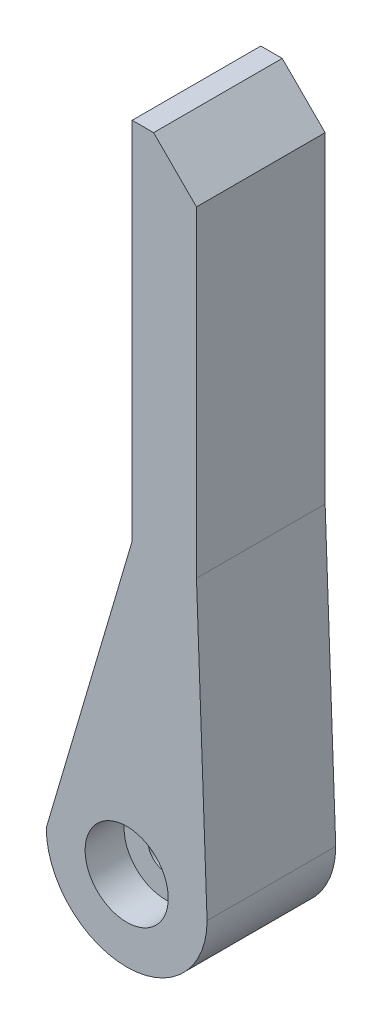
ISO-10303-21;
HEADER;
FILE_DESCRIPTION(('STEP AP214'),'2;1');
FILE_NAME('part.step','',(''),(''),'','','');
FILE_SCHEMA(('AUTOMOTIVE_DESIGN { 1 0 10303 214 1 1 1 1 }'));
ENDSEC;
DATA;
#1=APPLICATION_CONTEXT('core data for automotive mechanical design processes');
#2=APPLICATION_PROTOCOL_DEFINITION('international standard','automotive_design',2000,#1);
#3=PRODUCT_CONTEXT('',#1,'mechanical');
#4=PRODUCT('Part','Part','',(#3));
#5=PRODUCT_RELATED_PRODUCT_CATEGORY('part','',(#4));
#6=PRODUCT_DEFINITION_FORMATION('','',#4);
#7=PRODUCT_DEFINITION_CONTEXT('part definition',#1,'design');
#8=PRODUCT_DEFINITION('design','',#6,#7);
#9=PRODUCT_DEFINITION_SHAPE('','',#8);
#10=(LENGTH_UNIT() NAMED_UNIT(*) SI_UNIT(.MILLI.,.METRE.));
#11=(NAMED_UNIT(*) PLANE_ANGLE_UNIT() SI_UNIT($,.RADIAN.));
#12=(NAMED_UNIT(*) SI_UNIT($,.STERADIAN.) SOLID_ANGLE_UNIT());
#13=UNCERTAINTY_MEASURE_WITH_UNIT(LENGTH_MEASURE(1.E-05),#10,'distance_accuracy_value','');
#14=(GEOMETRIC_REPRESENTATION_CONTEXT(3) GLOBAL_UNCERTAINTY_ASSIGNED_CONTEXT((#13)) GLOBAL_UNIT_ASSIGNED_CONTEXT((#10,
#11,#12)) REPRESENTATION_CONTEXT('',''));
#15=CARTESIAN_POINT('',(0.,0.,0.));
#16=DIRECTION('',(0.,0.,1.));
#17=DIRECTION('',(1.,0.,0.));
#18=AXIS2_PLACEMENT_3D('',#15,#16,#17);
#19=CARTESIAN_POINT('',(-9.2785057,9.4199964,10.16));
#20=DIRECTION('',(0.999339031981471,0.0363524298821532,0.));
#21=DIRECTION('',(-0.0363524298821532,0.999339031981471,0.));
#22=AXIS2_PLACEMENT_3D('',#19,#20,#21);
#23=PLANE('',#22);
#24=DIRECTION('',(-0.0363524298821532,0.999339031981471,0.));
#25=VECTOR('',#24,1.);
#26=CARTESIAN_POINT('',(-9.2785057,9.4199964,17.78));
#27=LINE('',#26,#25);
#28=CARTESIAN_POINT('',(-9.2785057,9.4199964,17.78));
#29=VERTEX_POINT('',#28);
#30=CARTESIAN_POINT('',(-9.906,26.67,17.78));
#31=VERTEX_POINT('',#30);
#32=EDGE_CURVE('E134',#29,#31,#27,.T.);
#33=ORIENTED_EDGE('',*,*,#32,.F.);
#34=DIRECTION('',(0.,0.,1.));
#35=VECTOR('',#34,1.);
#36=CARTESIAN_POINT('',(-9.2785057,9.4199964,10.16));
#37=LINE('',#36,#35);
#38=CARTESIAN_POINT('',(-9.2785057,9.4199964,10.16));
#39=VERTEX_POINT('',#38);
#40=EDGE_CURVE('E11',#39,#29,#37,.T.);
#41=ORIENTED_EDGE('',*,*,#40,.F.);
#42=DIRECTION('',(-0.0363524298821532,0.999339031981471,0.));
#43=VECTOR('',#42,1.);
#44=CARTESIAN_POINT('',(-9.2785057,9.4199964,10.16));
#45=LINE('',#44,#43);
#46=CARTESIAN_POINT('',(-9.906,26.67,10.16));
#47=VERTEX_POINT('',#46);
#48=EDGE_CURVE('E152',#39,#47,#45,.T.);
#49=ORIENTED_EDGE('',*,*,#48,.T.);
#50=DIRECTION('',(0.,0.,1.));
#51=VECTOR('',#50,1.);
#52=CARTESIAN_POINT('',(-9.906,26.67,10.16));
#53=LINE('',#52,#51);
#54=EDGE_CURVE('E46',#47,#31,#53,.T.);
#55=ORIENTED_EDGE('',*,*,#54,.T.);
#56=EDGE_LOOP('',(#33,#41,#49,#55));
#57=FACE_BOUND('',#56,.T.);
#58=ADVANCED_FACE('F43',(#57),#23,.T.);
#59=CARTESIAN_POINT('',(-14.0410057,9.4199964,10.16));
#60=DIRECTION('',(0.,0.,1.));
#61=DIRECTION('',(1.,0.,0.));
#62=AXIS2_PLACEMENT_3D('',#59,#60,#61);
#63=CYLINDRICAL_SURFACE('',#62,4.7625);
#64=CARTESIAN_POINT('',(-14.0410057,9.4199964,17.78));
#65=DIRECTION('',(0.,0.,1.));
#66=DIRECTION('',(1.,0.,0.));
#67=AXIS2_PLACEMENT_3D('',#64,#65,#66);
#68=CIRCLE('',#67,4.7625);
#69=CARTESIAN_POINT('',(-18.8035057,9.4199964,17.78));
#70=VERTEX_POINT('',#69);
#71=EDGE_CURVE('E150',#70,#29,#68,.T.);
#72=ORIENTED_EDGE('',*,*,#71,.F.);
#73=DIRECTION('',(0.,0.,1.));
#74=VECTOR('',#73,1.);
#75=CARTESIAN_POINT('',(-18.8035057,9.4199964,10.16));
#76=LINE('',#75,#74);
#77=CARTESIAN_POINT('',(-18.8035057,9.4199964,10.16));
#78=VERTEX_POINT('',#77);
#79=EDGE_CURVE('E52',#78,#70,#76,.T.);
#80=ORIENTED_EDGE('',*,*,#79,.F.);
#81=CARTESIAN_POINT('',(-14.0410057,9.4199964,10.16));
#82=DIRECTION('',(0.,0.,1.));
#83=DIRECTION('',(1.,0.,0.));
#84=AXIS2_PLACEMENT_3D('',#81,#82,#83);
#85=CIRCLE('',#84,4.7625);
#86=EDGE_CURVE('E124',#78,#39,#85,.T.);
#87=ORIENTED_EDGE('',*,*,#86,.T.);
#88=ORIENTED_EDGE('',*,*,#40,.T.);
#89=EDGE_LOOP('',(#72,#80,#87,#88));
#90=FACE_BOUND('',#89,.T.);
#91=ADVANCED_FACE('F162',(#90),#63,.T.);
#92=CARTESIAN_POINT('',(-13.716,26.67,10.16));
#93=DIRECTION('',(-0.959154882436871,0.282881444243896,0.));
#94=DIRECTION('',(-0.282881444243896,-0.959154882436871,0.));
#95=AXIS2_PLACEMENT_3D('',#92,#93,#94);
#96=PLANE('',#95);
#97=DIRECTION('',(-0.282881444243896,-0.959154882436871,0.));
#98=VECTOR('',#97,1.);
#99=CARTESIAN_POINT('',(-13.716,26.67,17.78));
#100=LINE('',#99,#98);
#101=CARTESIAN_POINT('',(-13.716,26.67,17.78));
#102=VERTEX_POINT('',#101);
#103=EDGE_CURVE('E111',#102,#70,#100,.T.);
#104=ORIENTED_EDGE('',*,*,#103,.F.);
#105=DIRECTION('',(0.,0.,1.));
#106=VECTOR('',#105,1.);
#107=CARTESIAN_POINT('',(-13.716,26.67,10.16));
#108=LINE('',#107,#106);
#109=CARTESIAN_POINT('',(-13.716,26.67,10.16));
#110=VERTEX_POINT('',#109);
#111=EDGE_CURVE('E106',#110,#102,#108,.T.);
#112=ORIENTED_EDGE('',*,*,#111,.F.);
#113=DIRECTION('',(-0.282881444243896,-0.959154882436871,0.));
#114=VECTOR('',#113,1.);
#115=CARTESIAN_POINT('',(-13.716,26.67,10.16));
#116=LINE('',#115,#114);
#117=EDGE_CURVE('E109',#110,#78,#116,.T.);
#118=ORIENTED_EDGE('',*,*,#117,.T.);
#119=ORIENTED_EDGE('',*,*,#79,.T.);
#120=EDGE_LOOP('',(#104,#112,#118,#119));
#121=FACE_BOUND('',#120,.T.);
#122=ADVANCED_FACE('F108',(#121),#96,.T.);
#123=CARTESIAN_POINT('',(-13.716,48.26,10.16));
#124=DIRECTION('',(-1.,0.,0.));
#125=DIRECTION('',(0.,0.,1.));
#126=AXIS2_PLACEMENT_3D('',#123,#124,#125);
#127=PLANE('',#126);
#128=DIRECTION('',(0.,-1.,0.));
#129=VECTOR('',#128,1.);
#130=CARTESIAN_POINT('',(-13.716,48.26,17.78));
#131=LINE('',#130,#129);
#132=CARTESIAN_POINT('',(-13.716,48.26,17.78));
#133=VERTEX_POINT('',#132);
#134=EDGE_CURVE('E147',#133,#102,#131,.T.);
#135=ORIENTED_EDGE('',*,*,#134,.F.);
#136=DIRECTION('',(0.,0.,1.));
#137=VECTOR('',#136,1.);
#138=CARTESIAN_POINT('',(-13.716,48.26,10.16));
#139=LINE('',#138,#137);
#140=CARTESIAN_POINT('',(-13.716,48.26,10.16));
#141=VERTEX_POINT('',#140);
#142=EDGE_CURVE('E116',#141,#133,#139,.T.);
#143=ORIENTED_EDGE('',*,*,#142,.F.);
#144=DIRECTION('',(0.,-1.,0.));
#145=VECTOR('',#144,1.);
#146=CARTESIAN_POINT('',(-13.716,48.26,10.16));
#147=LINE('',#146,#145);
#148=EDGE_CURVE('E122',#141,#110,#147,.T.);
#149=ORIENTED_EDGE('',*,*,#148,.T.);
#150=ORIENTED_EDGE('',*,*,#111,.T.);
#151=EDGE_LOOP('',(#135,#143,#149,#150));
#152=FACE_BOUND('',#151,.T.);
#153=ADVANCED_FACE('F126',(#152),#127,.T.);
#154=CARTESIAN_POINT('',(-12.446,48.26,10.16));
#155=DIRECTION('',(0.,1.,0.));
#156=DIRECTION('',(0.,0.,1.));
#157=AXIS2_PLACEMENT_3D('',#154,#155,#156);
#158=PLANE('',#157);
#159=DIRECTION('',(-1.,0.,0.));
#160=VECTOR('',#159,1.);
#161=CARTESIAN_POINT('',(-12.446,48.26,17.78));
#162=LINE('',#161,#160);
#163=CARTESIAN_POINT('',(-12.446,48.26,17.78));
#164=VERTEX_POINT('',#163);
#165=EDGE_CURVE('E144',#164,#133,#162,.T.);
#166=ORIENTED_EDGE('',*,*,#165,.F.);
#167=DIRECTION('',(0.,0.,1.));
#168=VECTOR('',#167,1.);
#169=CARTESIAN_POINT('',(-12.446,48.26,10.16));
#170=LINE('',#169,#168);
#171=CARTESIAN_POINT('',(-12.446,48.26,10.16));
#172=VERTEX_POINT('',#171);
#173=EDGE_CURVE('E156',#172,#164,#170,.T.);
#174=ORIENTED_EDGE('',*,*,#173,.F.);
#175=DIRECTION('',(-1.,0.,0.));
#176=VECTOR('',#175,1.);
#177=CARTESIAN_POINT('',(-12.446,48.26,10.16));
#178=LINE('',#177,#176);
#179=EDGE_CURVE('E127',#172,#141,#178,.T.);
#180=ORIENTED_EDGE('',*,*,#179,.T.);
#181=ORIENTED_EDGE('',*,*,#142,.T.);
#182=EDGE_LOOP('',(#166,#174,#180,#181));
#183=FACE_BOUND('',#182,.T.);
#184=ADVANCED_FACE('F175',(#183),#158,.T.);
#185=CARTESIAN_POINT('',(-9.906,45.72,10.16));
#186=DIRECTION('',(0.707106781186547,0.707106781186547,0.));
#187=DIRECTION('',(-0.707106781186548,0.707106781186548,0.));
#188=AXIS2_PLACEMENT_3D('',#185,#186,#187);
#189=PLANE('',#188);
#190=DIRECTION('',(-0.707106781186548,0.707106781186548,0.));
#191=VECTOR('',#190,1.);
#192=CARTESIAN_POINT('',(-9.906,45.72,17.78));
#193=LINE('',#192,#191);
#194=CARTESIAN_POINT('',(-9.906,45.72,17.78));
#195=VERTEX_POINT('',#194);
#196=EDGE_CURVE('E141',#195,#164,#193,.T.);
#197=ORIENTED_EDGE('',*,*,#196,.F.);
#198=DIRECTION('',(0.,0.,1.));
#199=VECTOR('',#198,1.);
#200=CARTESIAN_POINT('',(-9.906,45.72,10.16));
#201=LINE('',#200,#199);
#202=CARTESIAN_POINT('',(-9.906,45.72,10.16));
#203=VERTEX_POINT('',#202);
#204=EDGE_CURVE('E157',#203,#195,#201,.T.);
#205=ORIENTED_EDGE('',*,*,#204,.F.);
#206=DIRECTION('',(-0.707106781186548,0.707106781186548,0.));
#207=VECTOR('',#206,1.);
#208=CARTESIAN_POINT('',(-9.906,45.72,10.16));
#209=LINE('',#208,#207);
#210=EDGE_CURVE('E129',#203,#172,#209,.T.);
#211=ORIENTED_EDGE('',*,*,#210,.T.);
#212=ORIENTED_EDGE('',*,*,#173,.T.);
#213=EDGE_LOOP('',(#197,#205,#211,#212));
#214=FACE_BOUND('',#213,.T.);
#215=ADVANCED_FACE('F178',(#214),#189,.T.);
#216=CARTESIAN_POINT('',(-9.906,26.67,10.16));
#217=DIRECTION('',(1.,0.,0.));
#218=DIRECTION('',(0.,0.,-1.));
#219=AXIS2_PLACEMENT_3D('',#216,#217,#218);
#220=PLANE('',#219);
#221=DIRECTION('',(0.,1.,0.));
#222=VECTOR('',#221,1.);
#223=CARTESIAN_POINT('',(-9.906,26.67,17.78));
#224=LINE('',#223,#222);
#225=EDGE_CURVE('E137',#31,#195,#224,.T.);
#226=ORIENTED_EDGE('',*,*,#225,.F.);
#227=ORIENTED_EDGE('',*,*,#54,.F.);
#228=DIRECTION('',(0.,1.,0.));
#229=VECTOR('',#228,1.);
#230=CARTESIAN_POINT('',(-9.906,26.67,10.16));
#231=LINE('',#230,#229);
#232=EDGE_CURVE('E236',#47,#203,#231,.T.);
#233=ORIENTED_EDGE('',*,*,#232,.T.);
#234=ORIENTED_EDGE('',*,*,#204,.T.);
#235=EDGE_LOOP('',(#226,#227,#233,#234));
#236=FACE_BOUND('',#235,.T.);
#237=ADVANCED_FACE('F159',(#236),#220,.T.);
#238=CARTESIAN_POINT('',(-14.0410057,9.4199964,10.16));
#239=DIRECTION('',(0.,0.,1.));
#240=DIRECTION('',(1.,0.,0.));
#241=AXIS2_PLACEMENT_3D('',#238,#239,#240);
#242=PLANE('',#241);
#243=CARTESIAN_POINT('',(-14.0410057,9.4199964,10.16));
#244=DIRECTION('',(0.,0.,-1.));
#245=DIRECTION('',(-1.,0.,0.));
#246=AXIS2_PLACEMENT_3D('',#243,#244,#245);
#247=CIRCLE('',#246,2.4638);
#248=CARTESIAN_POINT('',(-16.5048057,9.4199964,10.16));
#249=VERTEX_POINT('',#248);
#250=EDGE_CURVE('E230',#249,#249,#247,.T.);
#251=ORIENTED_EDGE('',*,*,#250,.F.);
#252=EDGE_LOOP('',(#251));
#253=FACE_BOUND('',#252,.T.);
#254=ORIENTED_EDGE('',*,*,#48,.F.);
#255=ORIENTED_EDGE('',*,*,#86,.F.);
#256=ORIENTED_EDGE('',*,*,#117,.F.);
#257=ORIENTED_EDGE('',*,*,#148,.F.);
#258=ORIENTED_EDGE('',*,*,#179,.F.);
#259=ORIENTED_EDGE('',*,*,#210,.F.);
#260=ORIENTED_EDGE('',*,*,#232,.F.);
#261=EDGE_LOOP('',(#254,#255,#256,#257,#258,#259,#260));
#262=FACE_BOUND('',#261,.T.);
#263=ADVANCED_FACE('F120',(#253,#262),#242,.F.);
#264=CARTESIAN_POINT('',(-14.0410057,9.4199964,17.78));
#265=DIRECTION('',(0.,0.,1.));
#266=DIRECTION('',(1.,0.,0.));
#267=AXIS2_PLACEMENT_3D('',#264,#265,#266);
#268=PLANE('',#267);
#269=CARTESIAN_POINT('',(-14.0410057,9.4199964,17.78));
#270=DIRECTION('',(0.,0.,-1.));
#271=DIRECTION('',(-1.,0.,0.));
#272=AXIS2_PLACEMENT_3D('',#269,#270,#271);
#273=CIRCLE('',#272,2.4638);
#274=CARTESIAN_POINT('',(-16.5048057,9.4199964,17.78));
#275=VERTEX_POINT('',#274);
#276=EDGE_CURVE('E138',#275,#275,#273,.T.);
#277=ORIENTED_EDGE('',*,*,#276,.T.);
#278=EDGE_LOOP('',(#277));
#279=FACE_BOUND('',#278,.T.);
#280=ORIENTED_EDGE('',*,*,#32,.T.);
#281=ORIENTED_EDGE('',*,*,#225,.T.);
#282=ORIENTED_EDGE('',*,*,#196,.T.);
#283=ORIENTED_EDGE('',*,*,#165,.T.);
#284=ORIENTED_EDGE('',*,*,#134,.T.);
#285=ORIENTED_EDGE('',*,*,#103,.T.);
#286=ORIENTED_EDGE('',*,*,#71,.T.);
#287=EDGE_LOOP('',(#280,#281,#282,#283,#284,#285,#286));
#288=FACE_BOUND('',#287,.T.);
#289=ADVANCED_FACE('F161',(#279,#288),#268,.T.);
#290=CARTESIAN_POINT('',(-14.0410057,9.4199964,17.78));
#291=DIRECTION('',(0.,0.,-1.));
#292=DIRECTION('',(-1.,0.,0.));
#293=AXIS2_PLACEMENT_3D('',#290,#291,#292);
#294=CYLINDRICAL_SURFACE('',#293,2.4638);
#295=ORIENTED_EDGE('',*,*,#276,.F.);
#296=EDGE_LOOP('',(#295));
#297=FACE_BOUND('',#296,.T.);
#298=CARTESIAN_POINT('',(-14.0410057,9.4199964,15.4737562));
#299=DIRECTION('',(0.,0.,-1.));
#300=DIRECTION('',(-1.,0.,0.));
#301=AXIS2_PLACEMENT_3D('',#298,#299,#300);
#302=CIRCLE('',#301,2.4638);
#303=CARTESIAN_POINT('',(-16.5048057,9.4199964,15.4737562));
#304=VERTEX_POINT('',#303);
#305=EDGE_CURVE('E217',#304,#304,#302,.T.);
#306=ORIENTED_EDGE('',*,*,#305,.T.);
#307=EDGE_LOOP('',(#306));
#308=FACE_BOUND('',#307,.T.);
#309=ADVANCED_FACE('F190',(#297,#308),#294,.F.);
#310=CARTESIAN_POINT('',(-14.0410057,9.4199964,17.78));
#311=DIRECTION('',(0.,0.,-1.));
#312=DIRECTION('',(-1.,0.,0.));
#313=AXIS2_PLACEMENT_3D('',#310,#311,#312);
#314=CYLINDRICAL_SURFACE('',#313,2.4638);
#315=CARTESIAN_POINT('',(-14.0410057,9.4199964,12.9337562));
#316=DIRECTION('',(0.,0.,-1.));
#317=DIRECTION('',(-1.,0.,0.));
#318=AXIS2_PLACEMENT_3D('',#315,#316,#317);
#319=CIRCLE('',#318,2.4638);
#320=CARTESIAN_POINT('',(-16.5048057,9.4199964,12.9337562));
#321=VERTEX_POINT('',#320);
#322=EDGE_CURVE('E224',#321,#321,#319,.T.);
#323=ORIENTED_EDGE('',*,*,#322,.F.);
#324=EDGE_LOOP('',(#323));
#325=FACE_BOUND('',#324,.T.);
#326=ORIENTED_EDGE('',*,*,#250,.T.);
#327=EDGE_LOOP('',(#326));
#328=FACE_BOUND('',#327,.T.);
#329=ADVANCED_FACE('F196',(#325,#328),#314,.F.);
#330=CARTESIAN_POINT('',(-11.5772057,9.4199964,12.9337562));
#331=DIRECTION('',(0.,0.,1.));
#332=DIRECTION('',(1.,0.,0.));
#333=AXIS2_PLACEMENT_3D('',#330,#331,#332);
#334=PLANE('',#333);
#335=CARTESIAN_POINT('',(-14.0410057,9.4199964,12.9337562));
#336=DIRECTION('',(0.,0.,-1.));
#337=DIRECTION('',(-1.,0.,0.));
#338=AXIS2_PLACEMENT_3D('',#335,#336,#337);
#339=CIRCLE('',#338,1.0414);
#340=CARTESIAN_POINT('',(-15.0824057,9.4199964,12.9337562));
#341=VERTEX_POINT('',#340);
#342=EDGE_CURVE('E221',#341,#341,#339,.T.);
#343=ORIENTED_EDGE('',*,*,#342,.F.);
#344=EDGE_LOOP('',(#343));
#345=FACE_BOUND('',#344,.T.);
#346=ORIENTED_EDGE('',*,*,#322,.T.);
#347=EDGE_LOOP('',(#346));
#348=FACE_BOUND('',#347,.T.);
#349=ADVANCED_FACE('F200',(#345,#348),#334,.F.);
#350=CARTESIAN_POINT('',(-14.0410057,9.4199964,17.78));
#351=DIRECTION('',(0.,0.,-1.));
#352=DIRECTION('',(-1.,0.,0.));
#353=AXIS2_PLACEMENT_3D('',#350,#351,#352);
#354=CYLINDRICAL_SURFACE('',#353,1.0414);
#355=CARTESIAN_POINT('',(-14.0410057,9.4199964,15.4737562));
#356=DIRECTION('',(0.,0.,-1.));
#357=DIRECTION('',(-1.,0.,0.));
#358=AXIS2_PLACEMENT_3D('',#355,#356,#357);
#359=CIRCLE('',#358,1.0414);
#360=CARTESIAN_POINT('',(-15.0824057,9.4199964,15.4737562));
#361=VERTEX_POINT('',#360);
#362=EDGE_CURVE('E220',#361,#361,#359,.T.);
#363=ORIENTED_EDGE('',*,*,#362,.F.);
#364=EDGE_LOOP('',(#363));
#365=FACE_BOUND('',#364,.T.);
#366=ORIENTED_EDGE('',*,*,#342,.T.);
#367=EDGE_LOOP('',(#366));
#368=FACE_BOUND('',#367,.T.);
#369=ADVANCED_FACE('F204',(#365,#368),#354,.F.);
#370=CARTESIAN_POINT('',(-12.9996057,9.4199964,15.4737562));
#371=DIRECTION('',(0.,0.,-1.));
#372=DIRECTION('',(-1.,0.,0.));
#373=AXIS2_PLACEMENT_3D('',#370,#371,#372);
#374=PLANE('',#373);
#375=ORIENTED_EDGE('',*,*,#305,.F.);
#376=EDGE_LOOP('',(#375));
#377=FACE_BOUND('',#376,.T.);
#378=ORIENTED_EDGE('',*,*,#362,.T.);
#379=EDGE_LOOP('',(#378));
#380=FACE_BOUND('',#379,.T.);
#381=ADVANCED_FACE('F208',(#377,#380),#374,.F.);
#382=CLOSED_SHELL('',(#58,#91,#122,#153,#184,#215,#237,#263,#289,#309,#329,#349,#369,#381));
#383=MANIFOLD_SOLID_BREP('B2',#382);
#384=ADVANCED_BREP_SHAPE_REPRESENTATION('',(#18,#383),#14);
#385=SHAPE_DEFINITION_REPRESENTATION(#9,#384);
ENDSEC;
END-ISO-10303-21;
